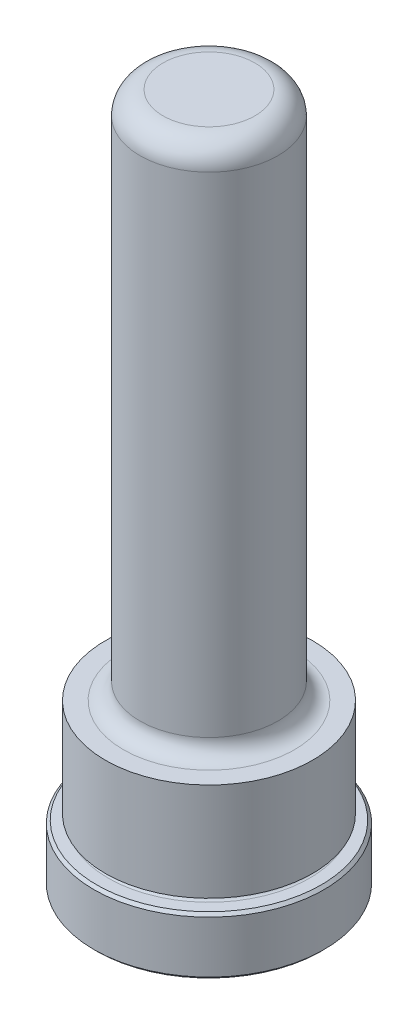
ISO-10303-21;
HEADER;
FILE_DESCRIPTION(('STEP AP214'),'2;1');
FILE_NAME('part.step','',(''),(''),'','','');
FILE_SCHEMA(('AUTOMOTIVE_DESIGN { 1 0 10303 214 1 1 1 1 }'));
ENDSEC;
DATA;
#1=APPLICATION_CONTEXT('core data for automotive mechanical design processes');
#2=APPLICATION_PROTOCOL_DEFINITION('international standard','automotive_design',2000,#1);
#3=PRODUCT_CONTEXT('',#1,'mechanical');
#4=PRODUCT('Part','Part','',(#3));
#5=PRODUCT_RELATED_PRODUCT_CATEGORY('part','',(#4));
#6=PRODUCT_DEFINITION_FORMATION('','',#4);
#7=PRODUCT_DEFINITION_CONTEXT('part definition',#1,'design');
#8=PRODUCT_DEFINITION('design','',#6,#7);
#9=PRODUCT_DEFINITION_SHAPE('','',#8);
#10=(LENGTH_UNIT() NAMED_UNIT(*) SI_UNIT(.MILLI.,.METRE.));
#11=(NAMED_UNIT(*) PLANE_ANGLE_UNIT() SI_UNIT($,.RADIAN.));
#12=(NAMED_UNIT(*) SI_UNIT($,.STERADIAN.) SOLID_ANGLE_UNIT());
#13=UNCERTAINTY_MEASURE_WITH_UNIT(LENGTH_MEASURE(1.E-05),#10,'distance_accuracy_value','');
#14=(GEOMETRIC_REPRESENTATION_CONTEXT(3) GLOBAL_UNCERTAINTY_ASSIGNED_CONTEXT((#13)) GLOBAL_UNIT_ASSIGNED_CONTEXT((#10,
#11,#12)) REPRESENTATION_CONTEXT('',''));
#15=CARTESIAN_POINT('',(0.,0.,0.));
#16=DIRECTION('',(0.,0.,1.));
#17=DIRECTION('',(1.,0.,0.));
#18=AXIS2_PLACEMENT_3D('',#15,#16,#17);
#19=CARTESIAN_POINT('',(0.,0.,0.));
#20=DIRECTION('',(0.,1.,0.));
#21=DIRECTION('',(0.,0.,1.));
#22=AXIS2_PLACEMENT_3D('',#19,#20,#21);
#23=PLANE('',#22);
#24=CARTESIAN_POINT('',(0.,0.,0.));
#25=DIRECTION('',(0.,1.,0.));
#26=DIRECTION('',(0.,0.,1.));
#27=AXIS2_PLACEMENT_3D('',#24,#25,#26);
#28=CIRCLE('',#27,15.494);
#29=CARTESIAN_POINT('',(0.,0.,15.494));
#30=VERTEX_POINT('',#29);
#31=EDGE_CURVE('E46',#30,#30,#28,.F.);
#32=ORIENTED_EDGE('',*,*,#31,.T.);
#33=EDGE_LOOP('',(#32));
#34=FACE_BOUND('',#33,.T.);
#35=ADVANCED_FACE('F31',(#34),#23,.F.);
#36=CARTESIAN_POINT('',(0.,0.,0.));
#37=DIRECTION('',(0.,1.,0.));
#38=DIRECTION('',(0.,0.,1.));
#39=AXIS2_PLACEMENT_3D('',#36,#37,#38);
#40=CYLINDRICAL_SURFACE('',#39,15.875);
#41=CARTESIAN_POINT('',(0.,0.380999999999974,0.));
#42=DIRECTION('',(0.,1.,0.));
#43=DIRECTION('',(0.,0.,1.));
#44=AXIS2_PLACEMENT_3D('',#41,#42,#43);
#45=CIRCLE('',#44,15.875);
#46=CARTESIAN_POINT('',(0.,0.380999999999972,15.875));
#47=VERTEX_POINT('',#46);
#48=EDGE_CURVE('E51',#47,#47,#45,.T.);
#49=ORIENTED_EDGE('',*,*,#48,.T.);
#50=EDGE_LOOP('',(#49));
#51=FACE_BOUND('',#50,.T.);
#52=CARTESIAN_POINT('',(0.,7.54380000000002,0.));
#53=DIRECTION('',(0.,-1.,0.));
#54=DIRECTION('',(0.,0.,-1.));
#55=AXIS2_PLACEMENT_3D('',#52,#53,#54);
#56=CIRCLE('',#55,15.875);
#57=CARTESIAN_POINT('',(0.,7.54380000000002,-15.875));
#58=VERTEX_POINT('',#57);
#59=EDGE_CURVE('E54',#58,#58,#56,.T.);
#60=ORIENTED_EDGE('',*,*,#59,.T.);
#61=EDGE_LOOP('',(#60));
#62=FACE_BOUND('',#61,.T.);
#63=ADVANCED_FACE('F110',(#51,#62),#40,.T.);
#64=CARTESIAN_POINT('',(0.,7.9248,-15.875));
#65=DIRECTION('',(0.,-1.,0.));
#66=DIRECTION('',(0.,0.,-1.));
#67=AXIS2_PLACEMENT_3D('',#64,#65,#66);
#68=PLANE('',#67);
#69=CARTESIAN_POINT('',(0.,7.9248,0.));
#70=DIRECTION('',(0.,-1.,0.));
#71=DIRECTION('',(0.,0.,-1.));
#72=AXIS2_PLACEMENT_3D('',#69,#70,#71);
#73=CIRCLE('',#72,15.494);
#74=CARTESIAN_POINT('',(0.,7.9248,-15.494));
#75=VERTEX_POINT('',#74);
#76=EDGE_CURVE('E42',#75,#75,#73,.F.);
#77=ORIENTED_EDGE('',*,*,#76,.T.);
#78=EDGE_LOOP('',(#77));
#79=FACE_BOUND('',#78,.T.);
#80=CARTESIAN_POINT('',(0.,7.9248,0.));
#81=DIRECTION('',(0.,1.,0.));
#82=DIRECTION('',(0.,0.,1.));
#83=AXIS2_PLACEMENT_3D('',#80,#81,#82);
#84=CIRCLE('',#83,13.8938);
#85=CARTESIAN_POINT('',(0.,7.9248,13.8938));
#86=VERTEX_POINT('',#85);
#87=EDGE_CURVE('E57',#86,#86,#84,.T.);
#88=ORIENTED_EDGE('',*,*,#87,.F.);
#89=EDGE_LOOP('',(#88));
#90=FACE_BOUND('',#89,.T.);
#91=ADVANCED_FACE('F105',(#79,#90),#68,.F.);
#92=CARTESIAN_POINT('',(0.,8.3058,0.));
#93=DIRECTION('',(0.,1.,0.));
#94=DIRECTION('',(0.,0.,1.));
#95=AXIS2_PLACEMENT_3D('',#92,#93,#94);
#96=TOROIDAL_SURFACE('',#95,13.8938,0.381000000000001);
#97=CARTESIAN_POINT('',(0.,8.68680000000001,0.));
#98=DIRECTION('',(0.,1.,0.));
#99=DIRECTION('',(0.,0.,1.));
#100=AXIS2_PLACEMENT_3D('',#97,#98,#99);
#101=CIRCLE('',#100,13.8938);
#102=CARTESIAN_POINT('',(0.,8.6868,13.8938));
#103=VERTEX_POINT('',#102);
#104=EDGE_CURVE('E60',#103,#103,#101,.T.);
#105=ORIENTED_EDGE('',*,*,#104,.F.);
#106=EDGE_LOOP('',(#105));
#107=FACE_BOUND('',#106,.T.);
#108=ORIENTED_EDGE('',*,*,#87,.T.);
#109=EDGE_LOOP('',(#108));
#110=FACE_BOUND('',#109,.T.);
#111=ADVANCED_FACE('F99',(#107,#110),#96,.F.);
#112=CARTESIAN_POINT('',(0.,8.68680000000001,-13.8938));
#113=DIRECTION('',(0.,1.,0.));
#114=DIRECTION('',(0.,0.,1.));
#115=AXIS2_PLACEMENT_3D('',#112,#113,#114);
#116=PLANE('',#115);
#117=CARTESIAN_POINT('',(0.,8.6868,0.));
#118=DIRECTION('',(0.,1.,0.));
#119=DIRECTION('',(0.,0.,1.));
#120=AXIS2_PLACEMENT_3D('',#117,#118,#119);
#121=CIRCLE('',#120,14.3002);
#122=CARTESIAN_POINT('',(0.,8.6868,14.3002));
#123=VERTEX_POINT('',#122);
#124=EDGE_CURVE('E63',#123,#123,#121,.T.);
#125=ORIENTED_EDGE('',*,*,#124,.F.);
#126=EDGE_LOOP('',(#125));
#127=FACE_BOUND('',#126,.T.);
#128=ORIENTED_EDGE('',*,*,#104,.T.);
#129=EDGE_LOOP('',(#128));
#130=FACE_BOUND('',#129,.T.);
#131=ADVANCED_FACE('F93',(#127,#130),#116,.F.);
#132=CARTESIAN_POINT('',(0.,0.,0.));
#133=DIRECTION('',(0.,1.,0.));
#134=DIRECTION('',(0.,0.,1.));
#135=AXIS2_PLACEMENT_3D('',#132,#133,#134);
#136=CYLINDRICAL_SURFACE('',#135,14.3002);
#137=CARTESIAN_POINT('',(0.,22.225,0.));
#138=DIRECTION('',(0.,1.,0.));
#139=DIRECTION('',(0.,0.,1.));
#140=AXIS2_PLACEMENT_3D('',#137,#138,#139);
#141=CIRCLE('',#140,14.3002);
#142=CARTESIAN_POINT('',(0.,22.225,14.3002));
#143=VERTEX_POINT('',#142);
#144=EDGE_CURVE('E66',#143,#143,#141,.T.);
#145=ORIENTED_EDGE('',*,*,#144,.F.);
#146=EDGE_LOOP('',(#145));
#147=FACE_BOUND('',#146,.T.);
#148=ORIENTED_EDGE('',*,*,#124,.T.);
#149=EDGE_LOOP('',(#148));
#150=FACE_BOUND('',#149,.T.);
#151=ADVANCED_FACE('F87',(#147,#150),#136,.T.);
#152=CARTESIAN_POINT('',(0.,22.225,-14.3002));
#153=DIRECTION('',(0.,-1.,0.));
#154=DIRECTION('',(0.,0.,-1.));
#155=AXIS2_PLACEMENT_3D('',#152,#153,#154);
#156=PLANE('',#155);
#157=CARTESIAN_POINT('',(0.,22.225,0.));
#158=DIRECTION('',(0.,1.,0.));
#159=DIRECTION('',(0.,0.,1.));
#160=AXIS2_PLACEMENT_3D('',#157,#158,#159);
#161=CIRCLE('',#160,11.7983);
#162=CARTESIAN_POINT('',(0.,22.225,11.7983));
#163=VERTEX_POINT('',#162);
#164=EDGE_CURVE('E69',#163,#163,#161,.T.);
#165=ORIENTED_EDGE('',*,*,#164,.F.);
#166=EDGE_LOOP('',(#165));
#167=FACE_BOUND('',#166,.T.);
#168=ORIENTED_EDGE('',*,*,#144,.T.);
#169=EDGE_LOOP('',(#168));
#170=FACE_BOUND('',#169,.T.);
#171=ADVANCED_FACE('F81',(#167,#170),#156,.F.);
#172=CARTESIAN_POINT('',(0.,24.511,0.));
#173=DIRECTION('',(0.,1.,0.));
#174=DIRECTION('',(0.,0.,1.));
#175=AXIS2_PLACEMENT_3D('',#172,#173,#174);
#176=TOROIDAL_SURFACE('',#175,11.7983,2.286);
#177=CARTESIAN_POINT('',(0.,24.511,0.));
#178=DIRECTION('',(0.,1.,0.));
#179=DIRECTION('',(0.,0.,1.));
#180=AXIS2_PLACEMENT_3D('',#177,#178,#179);
#181=CIRCLE('',#180,9.51229999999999);
#182=CARTESIAN_POINT('',(0.,24.511,9.5123));
#183=VERTEX_POINT('',#182);
#184=EDGE_CURVE('E72',#183,#183,#181,.T.);
#185=ORIENTED_EDGE('',*,*,#184,.F.);
#186=EDGE_LOOP('',(#185));
#187=FACE_BOUND('',#186,.T.);
#188=ORIENTED_EDGE('',*,*,#164,.T.);
#189=EDGE_LOOP('',(#188));
#190=FACE_BOUND('',#189,.T.);
#191=ADVANCED_FACE('F78',(#187,#190),#176,.F.);
#192=CARTESIAN_POINT('',(0.,0.,0.));
#193=DIRECTION('',(0.,1.,0.));
#194=DIRECTION('',(0.,0.,1.));
#195=AXIS2_PLACEMENT_3D('',#192,#193,#194);
#196=CYLINDRICAL_SURFACE('',#195,9.5123);
#197=CARTESIAN_POINT('',(0.,92.075,0.));
#198=DIRECTION('',(0.,-1.,0.));
#199=DIRECTION('',(0.,0.,-1.));
#200=AXIS2_PLACEMENT_3D('',#197,#198,#199);
#201=CIRCLE('',#200,9.5123);
#202=CARTESIAN_POINT('',(0.,92.075,-9.51229999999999));
#203=VERTEX_POINT('',#202);
#204=EDGE_CURVE('E10',#203,#203,#201,.T.);
#205=ORIENTED_EDGE('',*,*,#204,.T.);
#206=EDGE_LOOP('',(#205));
#207=FACE_BOUND('',#206,.T.);
#208=ORIENTED_EDGE('',*,*,#184,.T.);
#209=EDGE_LOOP('',(#208));
#210=FACE_BOUND('',#209,.T.);
#211=ADVANCED_FACE('F76',(#207,#210),#196,.T.);
#212=CARTESIAN_POINT('',(0.,95.25,-9.5123));
#213=DIRECTION('',(0.,-1.,0.));
#214=DIRECTION('',(0.,0.,-1.));
#215=AXIS2_PLACEMENT_3D('',#212,#213,#214);
#216=PLANE('',#215);
#217=CARTESIAN_POINT('',(0.,95.25,0.));
#218=DIRECTION('',(0.,-1.,0.));
#219=DIRECTION('',(0.,0.,-1.));
#220=AXIS2_PLACEMENT_3D('',#217,#218,#219);
#221=CIRCLE('',#220,6.3373);
#222=CARTESIAN_POINT('',(0.,95.25,-6.33729999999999));
#223=VERTEX_POINT('',#222);
#224=EDGE_CURVE('E38',#223,#223,#221,.F.);
#225=ORIENTED_EDGE('',*,*,#224,.T.);
#226=EDGE_LOOP('',(#225));
#227=FACE_BOUND('',#226,.T.);
#228=ADVANCED_FACE('F127',(#227),#216,.F.);
#229=CARTESIAN_POINT('',(0.,0.380999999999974,0.));
#230=DIRECTION('',(0.,1.,0.));
#231=DIRECTION('',(0.,0.,1.));
#232=AXIS2_PLACEMENT_3D('',#229,#230,#231);
#233=CONICAL_SURFACE('',#232,15.875,0.785398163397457);
#234=ORIENTED_EDGE('',*,*,#31,.F.);
#235=EDGE_LOOP('',(#234));
#236=FACE_BOUND('',#235,.T.);
#237=ORIENTED_EDGE('',*,*,#48,.F.);
#238=EDGE_LOOP('',(#237));
#239=FACE_BOUND('',#238,.T.);
#240=ADVANCED_FACE('F124',(#236,#239),#233,.T.);
#241=CARTESIAN_POINT('',(0.,7.9248,0.));
#242=DIRECTION('',(0.,-1.,0.));
#243=DIRECTION('',(0.,0.,-1.));
#244=AXIS2_PLACEMENT_3D('',#241,#242,#243);
#245=CONICAL_SURFACE('',#244,15.494,0.785398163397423);
#246=ORIENTED_EDGE('',*,*,#59,.F.);
#247=EDGE_LOOP('',(#246));
#248=FACE_BOUND('',#247,.T.);
#249=ORIENTED_EDGE('',*,*,#76,.F.);
#250=EDGE_LOOP('',(#249));
#251=FACE_BOUND('',#250,.T.);
#252=ADVANCED_FACE('F126',(#248,#251),#245,.T.);
#253=CARTESIAN_POINT('',(0.,92.075,0.));
#254=DIRECTION('',(0.,-1.,0.));
#255=DIRECTION('',(0.,0.,-1.));
#256=AXIS2_PLACEMENT_3D('',#253,#254,#255);
#257=TOROIDAL_SURFACE('',#256,6.3373,3.175);
#258=ORIENTED_EDGE('',*,*,#204,.F.);
#259=EDGE_LOOP('',(#258));
#260=FACE_BOUND('',#259,.T.);
#261=ORIENTED_EDGE('',*,*,#224,.F.);
#262=EDGE_LOOP('',(#261));
#263=FACE_BOUND('',#262,.T.);
#264=ADVANCED_FACE('F33',(#260,#263),#257,.T.);
#265=CLOSED_SHELL('',(#35,#63,#91,#111,#131,#151,#171,#191,#211,#228,#240,#252,#264));
#266=MANIFOLD_SOLID_BREP('B2',#265);
#267=ADVANCED_BREP_SHAPE_REPRESENTATION('',(#18,#266),#14);
#268=SHAPE_DEFINITION_REPRESENTATION(#9,#267);
ENDSEC;
END-ISO-10303-21;
